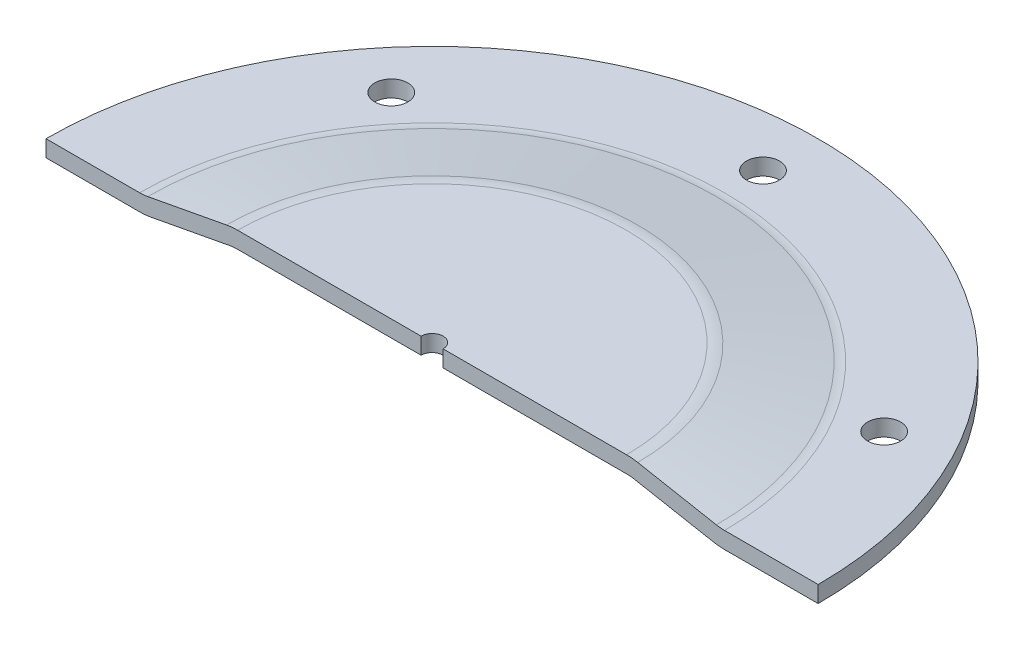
ISO-10303-21;
HEADER;
FILE_DESCRIPTION(('STEP AP214'),'2;1');
FILE_NAME('part.step','',(''),(''),'','','');
FILE_SCHEMA(('AUTOMOTIVE_DESIGN { 1 0 10303 214 1 1 1 1 }'));
ENDSEC;
DATA;
#1=APPLICATION_CONTEXT('core data for automotive mechanical design processes');
#2=APPLICATION_PROTOCOL_DEFINITION('international standard','automotive_design',2000,#1);
#3=PRODUCT_CONTEXT('',#1,'mechanical');
#4=PRODUCT('Part','Part','',(#3));
#5=PRODUCT_RELATED_PRODUCT_CATEGORY('part','',(#4));
#6=PRODUCT_DEFINITION_FORMATION('','',#4);
#7=PRODUCT_DEFINITION_CONTEXT('part definition',#1,'design');
#8=PRODUCT_DEFINITION('design','',#6,#7);
#9=PRODUCT_DEFINITION_SHAPE('','',#8);
#10=(LENGTH_UNIT() NAMED_UNIT(*) SI_UNIT(.MILLI.,.METRE.));
#11=(NAMED_UNIT(*) PLANE_ANGLE_UNIT() SI_UNIT($,.RADIAN.));
#12=(NAMED_UNIT(*) SI_UNIT($,.STERADIAN.) SOLID_ANGLE_UNIT());
#13=UNCERTAINTY_MEASURE_WITH_UNIT(LENGTH_MEASURE(1.E-05),#10,'distance_accuracy_value','');
#14=(GEOMETRIC_REPRESENTATION_CONTEXT(3) GLOBAL_UNCERTAINTY_ASSIGNED_CONTEXT((#13)) GLOBAL_UNIT_ASSIGNED_CONTEXT((#10,
#11,#12)) REPRESENTATION_CONTEXT('',''));
#15=CARTESIAN_POINT('',(0.,0.,0.));
#16=DIRECTION('',(0.,0.,1.));
#17=DIRECTION('',(1.,0.,0.));
#18=AXIS2_PLACEMENT_3D('',#15,#16,#17);
#19=CARTESIAN_POINT('',(0.,1.5,0.));
#20=DIRECTION('',(0.,-1.,0.));
#21=DIRECTION('',(0.,0.,-1.));
#22=AXIS2_PLACEMENT_3D('',#19,#20,#21);
#23=CYLINDRICAL_SURFACE('',#22,35.);
#24=DIRECTION('',(0.,1.,0.));
#25=VECTOR('',#24,1.);
#26=CARTESIAN_POINT('',(-35.,-1.49999999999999,-2.44403835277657E-13));
#27=LINE('',#26,#25);
#28=CARTESIAN_POINT('',(-35.,-1.49999999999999,-2.44403835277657E-13));
#29=VERTEX_POINT('',#28);
#30=CARTESIAN_POINT('',(-35.,0.,-2.44403835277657E-13));
#31=VERTEX_POINT('',#30);
#32=EDGE_CURVE('E129',#29,#31,#27,.T.);
#33=ORIENTED_EDGE('',*,*,#32,.T.);
#34=CARTESIAN_POINT('',(0.,0.,0.));
#35=DIRECTION('',(0.,-1.,0.));
#36=DIRECTION('',(0.,0.,-1.));
#37=AXIS2_PLACEMENT_3D('',#34,#35,#36);
#38=CIRCLE('',#37,35.);
#39=CARTESIAN_POINT('',(35.,0.,0.));
#40=VERTEX_POINT('',#39);
#41=EDGE_CURVE('E138',#31,#40,#38,.T.);
#42=ORIENTED_EDGE('',*,*,#41,.T.);
#43=DIRECTION('',(0.,1.,0.));
#44=VECTOR('',#43,1.);
#45=CARTESIAN_POINT('',(35.,-1.49999999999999,0.));
#46=LINE('',#45,#44);
#47=CARTESIAN_POINT('',(35.,-1.49999999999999,0.));
#48=VERTEX_POINT('',#47);
#49=EDGE_CURVE('E121',#48,#40,#46,.T.);
#50=ORIENTED_EDGE('',*,*,#49,.F.);
#51=CARTESIAN_POINT('',(0.,-1.49999999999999,0.));
#52=DIRECTION('',(0.,-1.,0.));
#53=DIRECTION('',(0.,0.,-1.));
#54=AXIS2_PLACEMENT_3D('',#51,#52,#53);
#55=CIRCLE('',#54,35.);
#56=EDGE_CURVE('E136',#29,#48,#55,.T.);
#57=ORIENTED_EDGE('',*,*,#56,.F.);
#58=EDGE_LOOP('',(#33,#42,#50,#57));
#59=FACE_BOUND('',#58,.T.);
#60=ADVANCED_FACE('F33',(#59),#23,.T.);
#61=CARTESIAN_POINT('',(-35.,0.,0.));
#62=DIRECTION('',(0.,-1.,0.));
#63=DIRECTION('',(0.,0.,-1.));
#64=AXIS2_PLACEMENT_3D('',#61,#62,#63);
#65=PLANE('',#64);
#66=CARTESIAN_POINT('',(0.,-5.6843418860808E-11,-30.));
#67=DIRECTION('',(0.,1.,0.));
#68=DIRECTION('',(0.,0.,1.));
#69=AXIS2_PLACEMENT_3D('',#66,#67,#68);
#70=CIRCLE('',#69,1.5);
#71=CARTESIAN_POINT('',(0.,-5.6843418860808E-11,-28.5));
#72=VERTEX_POINT('',#71);
#73=EDGE_CURVE('E148',#72,#72,#70,.T.);
#74=ORIENTED_EDGE('',*,*,#73,.F.);
#75=EDGE_LOOP('',(#74));
#76=FACE_BOUND('',#75,.T.);
#77=CARTESIAN_POINT('',(25.9807621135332,-5.6843418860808E-11,-15.));
#78=DIRECTION('',(0.,1.,0.));
#79=DIRECTION('',(-0.866025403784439,0.,0.499999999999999));
#80=AXIS2_PLACEMENT_3D('',#77,#78,#79);
#81=CIRCLE('',#80,1.5);
#82=CARTESIAN_POINT('',(24.6817240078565,-5.6843418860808E-11,-14.25));
#83=VERTEX_POINT('',#82);
#84=EDGE_CURVE('E203',#83,#83,#81,.T.);
#85=ORIENTED_EDGE('',*,*,#84,.F.);
#86=EDGE_LOOP('',(#85));
#87=FACE_BOUND('',#86,.T.);
#88=CARTESIAN_POINT('',(-22.9813332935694,-5.6843418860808E-11,-19.2836282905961));
#89=DIRECTION('',(0.,1.,0.));
#90=DIRECTION('',(0.766044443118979,0.,0.642787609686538));
#91=AXIS2_PLACEMENT_3D('',#88,#89,#90);
#92=CIRCLE('',#91,1.5);
#93=CARTESIAN_POINT('',(-21.8322666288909,-5.6843418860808E-11,-18.3194468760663));
#94=VERTEX_POINT('',#93);
#95=EDGE_CURVE('E190',#94,#94,#92,.T.);
#96=ORIENTED_EDGE('',*,*,#95,.F.);
#97=EDGE_LOOP('',(#96));
#98=FACE_BOUND('',#97,.T.);
#99=DIRECTION('',(-1.,0.,0.));
#100=VECTOR('',#99,1.);
#101=CARTESIAN_POINT('',(-35.,0.,-2.44403835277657E-13));
#102=LINE('',#101,#100);
#103=CARTESIAN_POINT('',(26.5111710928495,0.,1.85126625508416E-13));
#104=VERTEX_POINT('',#103);
#105=EDGE_CURVE('E194',#40,#104,#102,.T.);
#106=ORIENTED_EDGE('',*,*,#105,.F.);
#107=ORIENTED_EDGE('',*,*,#41,.F.);
#108=CARTESIAN_POINT('',(-26.5111710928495,0.,-1.85126625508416E-13));
#109=VERTEX_POINT('',#108);
#110=EDGE_CURVE('E188',#109,#31,#102,.T.);
#111=ORIENTED_EDGE('',*,*,#110,.F.);
#112=CARTESIAN_POINT('',(0.,0.,0.));
#113=DIRECTION('',(0.,-1.,0.));
#114=DIRECTION('',(0.,0.,-1.));
#115=AXIS2_PLACEMENT_3D('',#112,#113,#114);
#116=CIRCLE('',#115,26.5111710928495);
#117=EDGE_CURVE('E169',#109,#104,#116,.T.);
#118=ORIENTED_EDGE('',*,*,#117,.T.);
#119=EDGE_LOOP('',(#106,#107,#111,#118));
#120=FACE_BOUND('',#119,.T.);
#121=ADVANCED_FACE('F214',(#76,#87,#98,#120),#65,.F.);
#122=CARTESIAN_POINT('',(0.,4.00000000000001,0.));
#123=DIRECTION('',(0.,-1.,0.));
#124=DIRECTION('',(0.,0.,-1.));
#125=AXIS2_PLACEMENT_3D('',#122,#123,#124);
#126=TOROIDAL_SURFACE('',#125,26.5111710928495,4.);
#127=CARTESIAN_POINT('',(-26.5111710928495,4.00000000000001,-1.85126625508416E-13));
#128=DIRECTION('',(0.,0.,1.));
#129=DIRECTION('',(1.,0.,0.));
#130=AXIS2_PLACEMENT_3D('',#127,#128,#129);
#131=CIRCLE('',#130,4.);
#132=CARTESIAN_POINT('',(-25.7740169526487,0.0685112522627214,-1.79979102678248E-13));
#133=VERTEX_POINT('',#132);
#134=EDGE_CURVE('E192',#133,#109,#131,.F.);
#135=ORIENTED_EDGE('',*,*,#134,.F.);
#136=CARTESIAN_POINT('',(0.,0.0685112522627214,0.));
#137=DIRECTION('',(0.,-1.,0.));
#138=DIRECTION('',(0.,0.,-1.));
#139=AXIS2_PLACEMENT_3D('',#136,#137,#138);
#140=CIRCLE('',#139,25.7740169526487);
#141=CARTESIAN_POINT('',(25.7740169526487,0.0685112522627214,1.79979102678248E-13));
#142=VERTEX_POINT('',#141);
#143=EDGE_CURVE('E166',#133,#142,#140,.T.);
#144=ORIENTED_EDGE('',*,*,#143,.T.);
#145=CARTESIAN_POINT('',(26.5111710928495,4.00000000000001,1.85126625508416E-13));
#146=DIRECTION('',(0.,0.,1.));
#147=DIRECTION('',(1.,0.,0.));
#148=AXIS2_PLACEMENT_3D('',#145,#146,#147);
#149=CIRCLE('',#148,4.);
#150=EDGE_CURVE('E226',#104,#142,#149,.F.);
#151=ORIENTED_EDGE('',*,*,#150,.F.);
#152=ORIENTED_EDGE('',*,*,#117,.F.);
#153=EDGE_LOOP('',(#135,#144,#151,#152));
#154=FACE_BOUND('',#153,.T.);
#155=ADVANCED_FACE('F217',(#154),#126,.F.);
#156=CARTESIAN_POINT('',(0.,1.40579702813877,0.));
#157=DIRECTION('',(0.,-1.,0.));
#158=DIRECTION('',(0.,0.,-1.));
#159=AXIS2_PLACEMENT_3D('',#156,#157,#158);
#160=CONICAL_SURFACE('',#159,18.6418261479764,1.3854483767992);
#161=DIRECTION('',(-0.982872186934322,-0.184288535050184,0.));
#162=VECTOR('',#161,1.);
#163=CARTESIAN_POINT('',(0.,4.90113943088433,0.));
#164=LINE('',#163,#162);
#165=CARTESIAN_POINT('',(-18.6418261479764,1.40579702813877,-1.30175251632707E-13));
#166=VERTEX_POINT('',#165);
#167=EDGE_CURVE('E227',#166,#133,#164,.T.);
#168=ORIENTED_EDGE('',*,*,#167,.F.);
#169=CARTESIAN_POINT('',(0.,1.40579702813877,0.));
#170=DIRECTION('',(0.,-1.,0.));
#171=DIRECTION('',(0.,0.,-1.));
#172=AXIS2_PLACEMENT_3D('',#169,#170,#171);
#173=CIRCLE('',#172,18.6418261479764);
#174=CARTESIAN_POINT('',(18.6418261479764,1.40579702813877,1.30175251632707E-13));
#175=VERTEX_POINT('',#174);
#176=EDGE_CURVE('E163',#166,#175,#173,.T.);
#177=ORIENTED_EDGE('',*,*,#176,.T.);
#178=DIRECTION('',(-0.982872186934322,0.184288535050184,0.));
#179=VECTOR('',#178,1.);
#180=CARTESIAN_POINT('',(0.,4.90113943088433,0.));
#181=LINE('',#180,#179);
#182=EDGE_CURVE('E229',#142,#175,#181,.T.);
#183=ORIENTED_EDGE('',*,*,#182,.F.);
#184=ORIENTED_EDGE('',*,*,#143,.F.);
#185=EDGE_LOOP('',(#168,#177,#183,#184));
#186=FACE_BOUND('',#185,.T.);
#187=ADVANCED_FACE('F239',(#186),#160,.T.);
#188=CARTESIAN_POINT('',(0.,-4.,0.));
#189=DIRECTION('',(0.,-1.,0.));
#190=DIRECTION('',(0.,0.,-1.));
#191=AXIS2_PLACEMENT_3D('',#188,#189,#190);
#192=TOROIDAL_SURFACE('',#191,17.6282392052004,5.5);
#193=CARTESIAN_POINT('',(-17.6282392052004,-4.,-1.23097407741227E-13));
#194=DIRECTION('',(0.,0.,1.));
#195=DIRECTION('',(1.,0.,0.));
#196=AXIS2_PLACEMENT_3D('',#193,#194,#195);
#197=CIRCLE('',#196,5.5);
#198=CARTESIAN_POINT('',(-17.6282392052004,1.5,-1.23097407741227E-13));
#199=VERTEX_POINT('',#198);
#200=EDGE_CURVE('E225',#199,#166,#197,.T.);
#201=ORIENTED_EDGE('',*,*,#200,.F.);
#202=CARTESIAN_POINT('',(0.,1.5,0.));
#203=DIRECTION('',(0.,-1.,0.));
#204=DIRECTION('',(0.,0.,-1.));
#205=AXIS2_PLACEMENT_3D('',#202,#203,#204);
#206=CIRCLE('',#205,17.6282392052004);
#207=CARTESIAN_POINT('',(17.6282392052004,1.5,1.23097407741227E-13));
#208=VERTEX_POINT('',#207);
#209=EDGE_CURVE('E160',#199,#208,#206,.T.);
#210=ORIENTED_EDGE('',*,*,#209,.T.);
#211=CARTESIAN_POINT('',(17.6282392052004,-4.,1.23097407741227E-13));
#212=DIRECTION('',(0.,0.,1.));
#213=DIRECTION('',(1.,0.,0.));
#214=AXIS2_PLACEMENT_3D('',#211,#212,#213);
#215=CIRCLE('',#214,5.5);
#216=EDGE_CURVE('E241',#175,#208,#215,.T.);
#217=ORIENTED_EDGE('',*,*,#216,.F.);
#218=ORIENTED_EDGE('',*,*,#176,.F.);
#219=EDGE_LOOP('',(#201,#210,#217,#218));
#220=FACE_BOUND('',#219,.T.);
#221=ADVANCED_FACE('F281',(#220),#192,.T.);
#222=CARTESIAN_POINT('',(-17.6282392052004,1.5,0.));
#223=DIRECTION('',(0.,-1.,0.));
#224=DIRECTION('',(0.,0.,-1.));
#225=AXIS2_PLACEMENT_3D('',#222,#223,#224);
#226=PLANE('',#225);
#227=DIRECTION('',(1.,0.,0.));
#228=VECTOR('',#227,1.);
#229=CARTESIAN_POINT('',(0.,1.5,0.));
#230=LINE('',#229,#228);
#231=CARTESIAN_POINT('',(1.,1.5,0.));
#232=VERTEX_POINT('',#231);
#233=EDGE_CURVE('E54',#232,#208,#230,.T.);
#234=ORIENTED_EDGE('',*,*,#233,.T.);
#235=ORIENTED_EDGE('',*,*,#209,.F.);
#236=CARTESIAN_POINT('',(-0.999999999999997,1.5,0.));
#237=VERTEX_POINT('',#236);
#238=EDGE_CURVE('E174',#199,#237,#230,.T.);
#239=ORIENTED_EDGE('',*,*,#238,.T.);
#240=CARTESIAN_POINT('',(0.,1.5,0.));
#241=DIRECTION('',(0.,1.,0.));
#242=DIRECTION('',(0.,0.,1.));
#243=AXIS2_PLACEMENT_3D('',#240,#241,#242);
#244=CIRCLE('',#243,1.);
#245=EDGE_CURVE('E184',#232,#237,#244,.T.);
#246=ORIENTED_EDGE('',*,*,#245,.F.);
#247=EDGE_LOOP('',(#234,#235,#239,#246));
#248=FACE_BOUND('',#247,.T.);
#249=ADVANCED_FACE('F183',(#248),#226,.F.);
#250=CARTESIAN_POINT('',(0.,0.,0.));
#251=DIRECTION('',(0.,1.,0.));
#252=DIRECTION('',(0.,0.,1.));
#253=AXIS2_PLACEMENT_3D('',#250,#251,#252);
#254=PLANE('',#253);
#255=DIRECTION('',(1.,0.,0.));
#256=VECTOR('',#255,1.);
#257=CARTESIAN_POINT('',(0.,0.,0.));
#258=LINE('',#257,#256);
#259=CARTESIAN_POINT('',(-17.6282392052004,0.,-1.23097407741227E-13));
#260=VERTEX_POINT('',#259);
#261=CARTESIAN_POINT('',(-0.999999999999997,0.,0.));
#262=VERTEX_POINT('',#261);
#263=EDGE_CURVE('E47',#260,#262,#258,.T.);
#264=ORIENTED_EDGE('',*,*,#263,.F.);
#265=CARTESIAN_POINT('',(0.,0.,0.));
#266=DIRECTION('',(0.,-1.,0.));
#267=DIRECTION('',(0.,0.,-1.));
#268=AXIS2_PLACEMENT_3D('',#265,#266,#267);
#269=CIRCLE('',#268,17.6282392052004);
#270=CARTESIAN_POINT('',(17.6282392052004,0.,1.23097407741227E-13));
#271=VERTEX_POINT('',#270);
#272=EDGE_CURVE('E157',#260,#271,#269,.T.);
#273=ORIENTED_EDGE('',*,*,#272,.T.);
#274=CARTESIAN_POINT('',(1.,0.,0.));
#275=VERTEX_POINT('',#274);
#276=EDGE_CURVE('E249',#275,#271,#258,.T.);
#277=ORIENTED_EDGE('',*,*,#276,.F.);
#278=CARTESIAN_POINT('',(0.,0.,0.));
#279=DIRECTION('',(0.,1.,0.));
#280=DIRECTION('',(0.,0.,1.));
#281=AXIS2_PLACEMENT_3D('',#278,#279,#280);
#282=CIRCLE('',#281,1.);
#283=EDGE_CURVE('E187',#262,#275,#282,.F.);
#284=ORIENTED_EDGE('',*,*,#283,.F.);
#285=EDGE_LOOP('',(#264,#273,#277,#284));
#286=FACE_BOUND('',#285,.T.);
#287=ADVANCED_FACE('F273',(#286),#254,.F.);
#288=CARTESIAN_POINT('',(0.,-4.,0.));
#289=DIRECTION('',(0.,-1.,0.));
#290=DIRECTION('',(0.,0.,-1.));
#291=AXIS2_PLACEMENT_3D('',#288,#289,#290);
#292=TOROIDAL_SURFACE('',#291,17.6282392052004,4.);
#293=CARTESIAN_POINT('',(-17.6282392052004,-4.,-1.23097407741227E-13));
#294=DIRECTION('',(0.,0.,1.));
#295=DIRECTION('',(1.,0.,0.));
#296=AXIS2_PLACEMENT_3D('',#293,#294,#295);
#297=CIRCLE('',#296,4.);
#298=CARTESIAN_POINT('',(-18.3653933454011,-0.0685112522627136,-1.28244930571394E-13));
#299=VERTEX_POINT('',#298);
#300=EDGE_CURVE('E254',#299,#260,#297,.F.);
#301=ORIENTED_EDGE('',*,*,#300,.F.);
#302=CARTESIAN_POINT('',(0.,-0.0685112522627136,0.));
#303=DIRECTION('',(0.,-1.,0.));
#304=DIRECTION('',(0.,0.,-1.));
#305=AXIS2_PLACEMENT_3D('',#302,#303,#304);
#306=CIRCLE('',#305,18.3653933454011);
#307=CARTESIAN_POINT('',(18.3653933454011,-0.0685112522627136,1.28244930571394E-13));
#308=VERTEX_POINT('',#307);
#309=EDGE_CURVE('E154',#299,#308,#306,.T.);
#310=ORIENTED_EDGE('',*,*,#309,.T.);
#311=CARTESIAN_POINT('',(17.6282392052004,-4.,1.23097407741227E-13));
#312=DIRECTION('',(0.,0.,1.));
#313=DIRECTION('',(1.,0.,0.));
#314=AXIS2_PLACEMENT_3D('',#311,#312,#313);
#315=CIRCLE('',#314,4.);
#316=EDGE_CURVE('E247',#271,#308,#315,.F.);
#317=ORIENTED_EDGE('',*,*,#316,.F.);
#318=ORIENTED_EDGE('',*,*,#272,.F.);
#319=EDGE_LOOP('',(#301,#310,#317,#318));
#320=FACE_BOUND('',#319,.T.);
#321=ADVANCED_FACE('F269',(#320),#292,.F.);
#322=CARTESIAN_POINT('',(0.,-1.40579702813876,0.));
#323=DIRECTION('',(0.,-1.,0.));
#324=DIRECTION('',(0.,0.,-1.));
#325=AXIS2_PLACEMENT_3D('',#322,#323,#324);
#326=CONICAL_SURFACE('',#325,25.4975841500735,1.3854483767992);
#327=DIRECTION('',(-0.982872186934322,-0.184288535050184,0.));
#328=VECTOR('',#327,1.);
#329=CARTESIAN_POINT('',(0.,3.37499999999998,0.));
#330=LINE('',#329,#328);
#331=CARTESIAN_POINT('',(-25.4975841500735,-1.40579702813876,-1.78048781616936E-13));
#332=VERTEX_POINT('',#331);
#333=EDGE_CURVE('E252',#332,#299,#330,.F.);
#334=ORIENTED_EDGE('',*,*,#333,.F.);
#335=CARTESIAN_POINT('',(0.,-1.40579702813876,0.));
#336=DIRECTION('',(0.,-1.,0.));
#337=DIRECTION('',(0.,0.,-1.));
#338=AXIS2_PLACEMENT_3D('',#335,#336,#337);
#339=CIRCLE('',#338,25.4975841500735);
#340=CARTESIAN_POINT('',(25.4975841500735,-1.40579702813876,1.78048781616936E-13));
#341=VERTEX_POINT('',#340);
#342=EDGE_CURVE('E145',#332,#341,#339,.T.);
#343=ORIENTED_EDGE('',*,*,#342,.T.);
#344=DIRECTION('',(-0.982872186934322,0.184288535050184,0.));
#345=VECTOR('',#344,1.);
#346=CARTESIAN_POINT('',(0.,3.37499999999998,0.));
#347=LINE('',#346,#345);
#348=EDGE_CURVE('E245',#308,#341,#347,.F.);
#349=ORIENTED_EDGE('',*,*,#348,.F.);
#350=ORIENTED_EDGE('',*,*,#309,.F.);
#351=EDGE_LOOP('',(#334,#343,#349,#350));
#352=FACE_BOUND('',#351,.T.);
#353=ADVANCED_FACE('F264',(#352),#326,.F.);
#354=CARTESIAN_POINT('',(0.,4.00000000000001,0.));
#355=DIRECTION('',(0.,-1.,0.));
#356=DIRECTION('',(0.,0.,-1.));
#357=AXIS2_PLACEMENT_3D('',#354,#355,#356);
#358=TOROIDAL_SURFACE('',#357,26.5111710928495,5.5);
#359=CARTESIAN_POINT('',(-26.5111710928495,4.00000000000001,-1.85126625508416E-13));
#360=DIRECTION('',(0.,0.,1.));
#361=DIRECTION('',(1.,0.,0.));
#362=AXIS2_PLACEMENT_3D('',#359,#360,#361);
#363=CIRCLE('',#362,5.5);
#364=CARTESIAN_POINT('',(-26.5111710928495,-1.49999999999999,-1.85126625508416E-13));
#365=VERTEX_POINT('',#364);
#366=EDGE_CURVE('E250',#365,#332,#363,.T.);
#367=ORIENTED_EDGE('',*,*,#366,.F.);
#368=CARTESIAN_POINT('',(0.,-1.49999999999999,0.));
#369=DIRECTION('',(0.,-1.,0.));
#370=DIRECTION('',(0.,0.,-1.));
#371=AXIS2_PLACEMENT_3D('',#368,#369,#370);
#372=CIRCLE('',#371,26.5111710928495);
#373=CARTESIAN_POINT('',(26.5111710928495,-1.49999999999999,1.85126625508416E-13));
#374=VERTEX_POINT('',#373);
#375=EDGE_CURVE('E142',#365,#374,#372,.T.);
#376=ORIENTED_EDGE('',*,*,#375,.T.);
#377=CARTESIAN_POINT('',(26.5111710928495,4.00000000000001,1.85126625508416E-13));
#378=DIRECTION('',(0.,0.,1.));
#379=DIRECTION('',(1.,0.,0.));
#380=AXIS2_PLACEMENT_3D('',#377,#378,#379);
#381=CIRCLE('',#380,5.5);
#382=EDGE_CURVE('E124',#341,#374,#381,.T.);
#383=ORIENTED_EDGE('',*,*,#382,.F.);
#384=ORIENTED_EDGE('',*,*,#342,.F.);
#385=EDGE_LOOP('',(#367,#376,#383,#384));
#386=FACE_BOUND('',#385,.T.);
#387=ADVANCED_FACE('F261',(#386),#358,.T.);
#388=CARTESIAN_POINT('',(-26.5111710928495,-1.49999999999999,0.));
#389=DIRECTION('',(0.,1.,0.));
#390=DIRECTION('',(0.,0.,1.));
#391=AXIS2_PLACEMENT_3D('',#388,#389,#390);
#392=PLANE('',#391);
#393=CARTESIAN_POINT('',(0.,-1.49999999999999,-30.));
#394=DIRECTION('',(0.,1.,0.));
#395=DIRECTION('',(0.,0.,1.));
#396=AXIS2_PLACEMENT_3D('',#393,#394,#395);
#397=CIRCLE('',#396,1.5);
#398=CARTESIAN_POINT('',(0.,-1.49999999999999,-28.5));
#399=VERTEX_POINT('',#398);
#400=EDGE_CURVE('E143',#399,#399,#397,.F.);
#401=ORIENTED_EDGE('',*,*,#400,.F.);
#402=EDGE_LOOP('',(#401));
#403=FACE_BOUND('',#402,.T.);
#404=CARTESIAN_POINT('',(25.9807621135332,-1.49999999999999,-15.));
#405=DIRECTION('',(0.,1.,0.));
#406=DIRECTION('',(0.,0.,1.));
#407=AXIS2_PLACEMENT_3D('',#404,#405,#406);
#408=CIRCLE('',#407,1.5);
#409=CARTESIAN_POINT('',(25.9807621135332,-1.49999999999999,-13.5));
#410=VERTEX_POINT('',#409);
#411=EDGE_CURVE('E206',#410,#410,#408,.F.);
#412=ORIENTED_EDGE('',*,*,#411,.F.);
#413=EDGE_LOOP('',(#412));
#414=FACE_BOUND('',#413,.T.);
#415=CARTESIAN_POINT('',(-22.9813332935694,-1.49999999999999,-19.2836282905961));
#416=DIRECTION('',(0.,1.,0.));
#417=DIRECTION('',(0.,0.,1.));
#418=AXIS2_PLACEMENT_3D('',#415,#416,#417);
#419=CIRCLE('',#418,1.5);
#420=CARTESIAN_POINT('',(-22.9813332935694,-1.49999999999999,-17.7836282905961));
#421=VERTEX_POINT('',#420);
#422=EDGE_CURVE('E200',#421,#421,#419,.F.);
#423=ORIENTED_EDGE('',*,*,#422,.F.);
#424=EDGE_LOOP('',(#423));
#425=FACE_BOUND('',#424,.T.);
#426=DIRECTION('',(-1.,0.,0.));
#427=VECTOR('',#426,1.);
#428=CARTESIAN_POINT('',(0.,-1.49999999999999,0.));
#429=LINE('',#428,#427);
#430=EDGE_CURVE('E130',#365,#29,#429,.T.);
#431=ORIENTED_EDGE('',*,*,#430,.T.);
#432=ORIENTED_EDGE('',*,*,#56,.T.);
#433=EDGE_CURVE('E118',#48,#374,#429,.T.);
#434=ORIENTED_EDGE('',*,*,#433,.T.);
#435=ORIENTED_EDGE('',*,*,#375,.F.);
#436=EDGE_LOOP('',(#431,#432,#434,#435));
#437=FACE_BOUND('',#436,.T.);
#438=ADVANCED_FACE('F141',(#403,#414,#425,#437),#392,.F.);
#439=CARTESIAN_POINT('',(0.,-1.50099999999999,0.));
#440=DIRECTION('',(0.,1.,0.));
#441=DIRECTION('',(0.,0.,1.));
#442=AXIS2_PLACEMENT_3D('',#439,#440,#441);
#443=CYLINDRICAL_SURFACE('',#442,1.);
#444=DIRECTION('',(0.,1.,0.));
#445=VECTOR('',#444,1.);
#446=CARTESIAN_POINT('',(1.,-1.50099999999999,0.));
#447=LINE('',#446,#445);
#448=EDGE_CURVE('E11',#232,#275,#447,.F.);
#449=ORIENTED_EDGE('',*,*,#448,.F.);
#450=ORIENTED_EDGE('',*,*,#245,.T.);
#451=DIRECTION('',(0.,1.,0.));
#452=VECTOR('',#451,1.);
#453=CARTESIAN_POINT('',(-0.999999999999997,-1.50099999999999,0.));
#454=LINE('',#453,#452);
#455=EDGE_CURVE('E40',#262,#237,#454,.T.);
#456=ORIENTED_EDGE('',*,*,#455,.F.);
#457=ORIENTED_EDGE('',*,*,#283,.T.);
#458=EDGE_LOOP('',(#449,#450,#456,#457));
#459=FACE_BOUND('',#458,.T.);
#460=ADVANCED_FACE('F186',(#459),#443,.F.);
#461=CARTESIAN_POINT('',(0.,-1.50099999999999,-30.));
#462=DIRECTION('',(0.,1.,0.));
#463=DIRECTION('',(0.,0.,1.));
#464=AXIS2_PLACEMENT_3D('',#461,#462,#463);
#465=CYLINDRICAL_SURFACE('',#464,1.5);
#466=ORIENTED_EDGE('',*,*,#73,.T.);
#467=EDGE_LOOP('',(#466));
#468=FACE_BOUND('',#467,.T.);
#469=ORIENTED_EDGE('',*,*,#400,.T.);
#470=EDGE_LOOP('',(#469));
#471=FACE_BOUND('',#470,.T.);
#472=ADVANCED_FACE('F211',(#468,#471),#465,.F.);
#473=CARTESIAN_POINT('',(25.9807621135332,-1.50099999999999,-15.));
#474=DIRECTION('',(0.,1.,0.));
#475=DIRECTION('',(0.,0.,1.));
#476=AXIS2_PLACEMENT_3D('',#473,#474,#475);
#477=CYLINDRICAL_SURFACE('',#476,1.5);
#478=ORIENTED_EDGE('',*,*,#84,.T.);
#479=EDGE_LOOP('',(#478));
#480=FACE_BOUND('',#479,.T.);
#481=ORIENTED_EDGE('',*,*,#411,.T.);
#482=EDGE_LOOP('',(#481));
#483=FACE_BOUND('',#482,.T.);
#484=ADVANCED_FACE('F386',(#480,#483),#477,.F.);
#485=CARTESIAN_POINT('',(-22.9813332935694,-1.50099999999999,-19.2836282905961));
#486=DIRECTION('',(0.,1.,0.));
#487=DIRECTION('',(0.,0.,1.));
#488=AXIS2_PLACEMENT_3D('',#485,#486,#487);
#489=CYLINDRICAL_SURFACE('',#488,1.5);
#490=ORIENTED_EDGE('',*,*,#95,.T.);
#491=EDGE_LOOP('',(#490));
#492=FACE_BOUND('',#491,.T.);
#493=ORIENTED_EDGE('',*,*,#422,.T.);
#494=EDGE_LOOP('',(#493));
#495=FACE_BOUND('',#494,.T.);
#496=ADVANCED_FACE('F368',(#492,#495),#489,.F.);
#497=CARTESIAN_POINT('',(0.,1.5,0.));
#498=DIRECTION('',(0.,0.,1.));
#499=DIRECTION('',(1.,0.,0.));
#500=AXIS2_PLACEMENT_3D('',#497,#498,#499);
#501=PLANE('',#500);
#502=ORIENTED_EDGE('',*,*,#110,.T.);
#503=ORIENTED_EDGE('',*,*,#32,.F.);
#504=ORIENTED_EDGE('',*,*,#430,.F.);
#505=ORIENTED_EDGE('',*,*,#366,.T.);
#506=ORIENTED_EDGE('',*,*,#333,.T.);
#507=ORIENTED_EDGE('',*,*,#300,.T.);
#508=ORIENTED_EDGE('',*,*,#263,.T.);
#509=ORIENTED_EDGE('',*,*,#455,.T.);
#510=ORIENTED_EDGE('',*,*,#238,.F.);
#511=ORIENTED_EDGE('',*,*,#200,.T.);
#512=ORIENTED_EDGE('',*,*,#167,.T.);
#513=ORIENTED_EDGE('',*,*,#134,.T.);
#514=EDGE_LOOP('',(#502,#503,#504,#505,#506,#507,#508,#509,#510,#511,#512,#513));
#515=FACE_BOUND('',#514,.T.);
#516=ADVANCED_FACE('F173',(#515),#501,.T.);
#517=ORIENTED_EDGE('',*,*,#105,.T.);
#518=ORIENTED_EDGE('',*,*,#150,.T.);
#519=ORIENTED_EDGE('',*,*,#182,.T.);
#520=ORIENTED_EDGE('',*,*,#216,.T.);
#521=ORIENTED_EDGE('',*,*,#233,.F.);
#522=ORIENTED_EDGE('',*,*,#448,.T.);
#523=ORIENTED_EDGE('',*,*,#276,.T.);
#524=ORIENTED_EDGE('',*,*,#316,.T.);
#525=ORIENTED_EDGE('',*,*,#348,.T.);
#526=ORIENTED_EDGE('',*,*,#382,.T.);
#527=ORIENTED_EDGE('',*,*,#433,.F.);
#528=ORIENTED_EDGE('',*,*,#49,.T.);
#529=EDGE_LOOP('',(#517,#518,#519,#520,#521,#522,#523,#524,#525,#526,#527,#528));
#530=FACE_BOUND('',#529,.T.);
#531=ADVANCED_FACE('F120',(#530),#501,.T.);
#532=CLOSED_SHELL('',(#60,#121,#155,#187,#221,#249,#287,#321,#353,#387,#438,#460,#472,#484,#496,
#516,#531));
#533=MANIFOLD_SOLID_BREP('B2',#532);
#534=ADVANCED_BREP_SHAPE_REPRESENTATION('',(#18,#533),#14);
#535=SHAPE_DEFINITION_REPRESENTATION(#9,#534);
ENDSEC;
END-ISO-10303-21;
